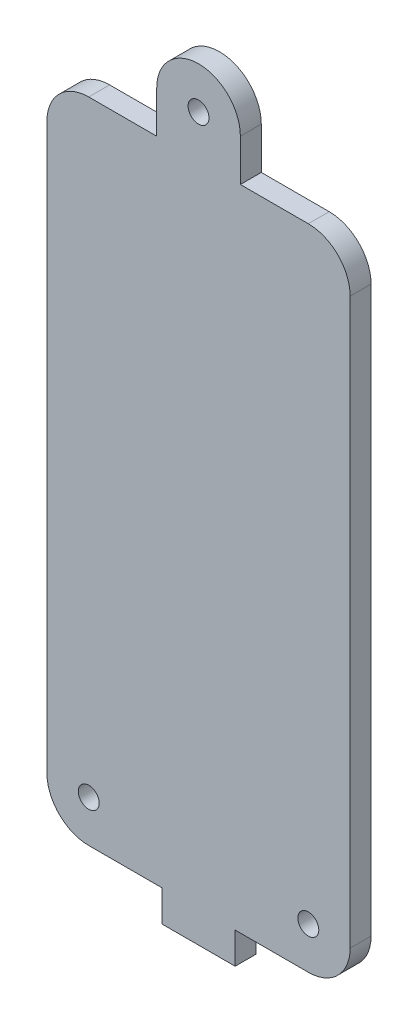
ISO-10303-21;
HEADER;
FILE_DESCRIPTION(('STEP AP214'),'2;1');
FILE_NAME('part.step','',(''),(''),'','','');
FILE_SCHEMA(('AUTOMOTIVE_DESIGN { 1 0 10303 214 1 1 1 1 }'));
ENDSEC;
DATA;
#1=APPLICATION_CONTEXT('core data for automotive mechanical design processes');
#2=APPLICATION_PROTOCOL_DEFINITION('international standard','automotive_design',2000,#1);
#3=PRODUCT_CONTEXT('',#1,'mechanical');
#4=PRODUCT('Part','Part','',(#3));
#5=PRODUCT_RELATED_PRODUCT_CATEGORY('part','',(#4));
#6=PRODUCT_DEFINITION_FORMATION('','',#4);
#7=PRODUCT_DEFINITION_CONTEXT('part definition',#1,'design');
#8=PRODUCT_DEFINITION('design','',#6,#7);
#9=PRODUCT_DEFINITION_SHAPE('','',#8);
#10=(LENGTH_UNIT() NAMED_UNIT(*) SI_UNIT(.MILLI.,.METRE.));
#11=(NAMED_UNIT(*) PLANE_ANGLE_UNIT() SI_UNIT($,.RADIAN.));
#12=(NAMED_UNIT(*) SI_UNIT($,.STERADIAN.) SOLID_ANGLE_UNIT());
#13=UNCERTAINTY_MEASURE_WITH_UNIT(LENGTH_MEASURE(1.E-05),#10,'distance_accuracy_value','');
#14=(GEOMETRIC_REPRESENTATION_CONTEXT(3) GLOBAL_UNCERTAINTY_ASSIGNED_CONTEXT((#13)) GLOBAL_UNIT_ASSIGNED_CONTEXT((#10,
#11,#12)) REPRESENTATION_CONTEXT('',''));
#15=CARTESIAN_POINT('',(0.,0.,0.));
#16=DIRECTION('',(0.,0.,1.));
#17=DIRECTION('',(1.,0.,0.));
#18=AXIS2_PLACEMENT_3D('',#15,#16,#17);
#19=CARTESIAN_POINT('',(-3.5,0.,2.));
#20=DIRECTION('',(1.,0.,0.));
#21=DIRECTION('',(0.,0.,-1.));
#22=AXIS2_PLACEMENT_3D('',#19,#20,#21);
#23=PLANE('',#22);
#24=DIRECTION('',(0.,-1.,0.));
#25=VECTOR('',#24,1.);
#26=CARTESIAN_POINT('',(-3.5,0.,0.));
#27=LINE('',#26,#25);
#28=CARTESIAN_POINT('',(-3.5,3.,0.));
#29=VERTEX_POINT('',#28);
#30=CARTESIAN_POINT('',(-3.5,0.,0.));
#31=VERTEX_POINT('',#30);
#32=EDGE_CURVE('E180',#29,#31,#27,.T.);
#33=ORIENTED_EDGE('',*,*,#32,.T.);
#34=DIRECTION('',(0.,0.,-1.));
#35=VECTOR('',#34,1.);
#36=CARTESIAN_POINT('',(-3.5,0.,2.));
#37=LINE('',#36,#35);
#38=CARTESIAN_POINT('',(-3.5,0.,2.));
#39=VERTEX_POINT('',#38);
#40=EDGE_CURVE('E11',#39,#31,#37,.T.);
#41=ORIENTED_EDGE('',*,*,#40,.F.);
#42=DIRECTION('',(0.,-1.,0.));
#43=VECTOR('',#42,1.);
#44=CARTESIAN_POINT('',(-3.5,0.,2.));
#45=LINE('',#44,#43);
#46=CARTESIAN_POINT('',(-3.5,3.,2.));
#47=VERTEX_POINT('',#46);
#48=EDGE_CURVE('E211',#47,#39,#45,.T.);
#49=ORIENTED_EDGE('',*,*,#48,.F.);
#50=DIRECTION('',(0.,0.,-1.));
#51=VECTOR('',#50,1.);
#52=CARTESIAN_POINT('',(-3.5,3.,2.));
#53=LINE('',#52,#51);
#54=EDGE_CURVE('E176',#47,#29,#53,.T.);
#55=ORIENTED_EDGE('',*,*,#54,.T.);
#56=EDGE_LOOP('',(#33,#41,#49,#55));
#57=FACE_BOUND('',#56,.T.);
#58=ADVANCED_FACE('F36',(#57),#23,.F.);
#59=CARTESIAN_POINT('',(3.5,0.,2.));
#60=DIRECTION('',(0.,1.,0.));
#61=DIRECTION('',(0.,0.,1.));
#62=AXIS2_PLACEMENT_3D('',#59,#60,#61);
#63=PLANE('',#62);
#64=DIRECTION('',(1.,0.,0.));
#65=VECTOR('',#64,1.);
#66=CARTESIAN_POINT('',(3.5,0.,0.));
#67=LINE('',#66,#65);
#68=CARTESIAN_POINT('',(3.5,0.,0.));
#69=VERTEX_POINT('',#68);
#70=EDGE_CURVE('E183',#31,#69,#67,.T.);
#71=ORIENTED_EDGE('',*,*,#70,.T.);
#72=DIRECTION('',(0.,0.,-1.));
#73=VECTOR('',#72,1.);
#74=CARTESIAN_POINT('',(3.5,0.,2.));
#75=LINE('',#74,#73);
#76=CARTESIAN_POINT('',(3.5,0.,2.));
#77=VERTEX_POINT('',#76);
#78=EDGE_CURVE('E44',#77,#69,#75,.T.);
#79=ORIENTED_EDGE('',*,*,#78,.F.);
#80=DIRECTION('',(1.,0.,0.));
#81=VECTOR('',#80,1.);
#82=CARTESIAN_POINT('',(3.5,0.,2.));
#83=LINE('',#82,#81);
#84=EDGE_CURVE('E119',#39,#77,#83,.T.);
#85=ORIENTED_EDGE('',*,*,#84,.F.);
#86=ORIENTED_EDGE('',*,*,#40,.T.);
#87=EDGE_LOOP('',(#71,#79,#85,#86));
#88=FACE_BOUND('',#87,.T.);
#89=ADVANCED_FACE('F311',(#88),#63,.F.);
#90=CARTESIAN_POINT('',(3.5,0.,2.));
#91=DIRECTION('',(-1.,0.,0.));
#92=DIRECTION('',(0.,0.,1.));
#93=AXIS2_PLACEMENT_3D('',#90,#91,#92);
#94=PLANE('',#93);
#95=DIRECTION('',(0.,1.,0.));
#96=VECTOR('',#95,1.);
#97=CARTESIAN_POINT('',(3.5,0.,0.));
#98=LINE('',#97,#96);
#99=CARTESIAN_POINT('',(3.5,3.,0.));
#100=VERTEX_POINT('',#99);
#101=EDGE_CURVE('E186',#69,#100,#98,.T.);
#102=ORIENTED_EDGE('',*,*,#101,.T.);
#103=DIRECTION('',(0.,0.,-1.));
#104=VECTOR('',#103,1.);
#105=CARTESIAN_POINT('',(3.5,3.,2.));
#106=LINE('',#105,#104);
#107=CARTESIAN_POINT('',(3.5,3.,2.));
#108=VERTEX_POINT('',#107);
#109=EDGE_CURVE('E242',#108,#100,#106,.T.);
#110=ORIENTED_EDGE('',*,*,#109,.F.);
#111=DIRECTION('',(0.,1.,0.));
#112=VECTOR('',#111,1.);
#113=CARTESIAN_POINT('',(3.5,0.,2.));
#114=LINE('',#113,#112);
#115=EDGE_CURVE('E250',#77,#108,#114,.T.);
#116=ORIENTED_EDGE('',*,*,#115,.F.);
#117=ORIENTED_EDGE('',*,*,#78,.T.);
#118=EDGE_LOOP('',(#102,#110,#116,#117));
#119=FACE_BOUND('',#118,.T.);
#120=ADVANCED_FACE('F248',(#119),#94,.F.);
#121=CARTESIAN_POINT('',(3.5,3.,2.));
#122=DIRECTION('',(0.,1.,0.));
#123=DIRECTION('',(-1.,0.,0.));
#124=AXIS2_PLACEMENT_3D('',#121,#122,#123);
#125=PLANE('',#124);
#126=DIRECTION('',(1.,0.,0.));
#127=VECTOR('',#126,1.);
#128=CARTESIAN_POINT('',(3.5,3.,0.));
#129=LINE('',#128,#127);
#130=CARTESIAN_POINT('',(10.5,3.,0.));
#131=VERTEX_POINT('',#130);
#132=EDGE_CURVE('E188',#100,#131,#129,.T.);
#133=ORIENTED_EDGE('',*,*,#132,.T.);
#134=DIRECTION('',(0.,0.,-1.));
#135=VECTOR('',#134,1.);
#136=CARTESIAN_POINT('',(10.5,3.,2.));
#137=LINE('',#136,#135);
#138=CARTESIAN_POINT('',(10.5,3.,2.));
#139=VERTEX_POINT('',#138);
#140=EDGE_CURVE('E239',#139,#131,#137,.T.);
#141=ORIENTED_EDGE('',*,*,#140,.F.);
#142=DIRECTION('',(1.,0.,0.));
#143=VECTOR('',#142,1.);
#144=CARTESIAN_POINT('',(3.5,3.,2.));
#145=LINE('',#144,#143);
#146=EDGE_CURVE('E268',#108,#139,#145,.T.);
#147=ORIENTED_EDGE('',*,*,#146,.F.);
#148=ORIENTED_EDGE('',*,*,#109,.T.);
#149=EDGE_LOOP('',(#133,#141,#147,#148));
#150=FACE_BOUND('',#149,.T.);
#151=ADVANCED_FACE('F259',(#150),#125,.F.);
#152=CARTESIAN_POINT('',(10.5,7.,2.));
#153=DIRECTION('',(0.,0.,-1.));
#154=DIRECTION('',(-1.,0.,0.));
#155=AXIS2_PLACEMENT_3D('',#152,#153,#154);
#156=CYLINDRICAL_SURFACE('',#155,4.);
#157=CARTESIAN_POINT('',(10.5,7.,0.));
#158=DIRECTION('',(0.,0.,1.));
#159=DIRECTION('',(1.,0.,0.));
#160=AXIS2_PLACEMENT_3D('',#157,#158,#159);
#161=CIRCLE('',#160,4.);
#162=CARTESIAN_POINT('',(14.5,7.,0.));
#163=VERTEX_POINT('',#162);
#164=EDGE_CURVE('E190',#131,#163,#161,.T.);
#165=ORIENTED_EDGE('',*,*,#164,.T.);
#166=DIRECTION('',(0.,0.,-1.));
#167=VECTOR('',#166,1.);
#168=CARTESIAN_POINT('',(14.5,7.,2.));
#169=LINE('',#168,#167);
#170=CARTESIAN_POINT('',(14.5,7.,2.));
#171=VERTEX_POINT('',#170);
#172=EDGE_CURVE('E236',#171,#163,#169,.T.);
#173=ORIENTED_EDGE('',*,*,#172,.F.);
#174=CARTESIAN_POINT('',(10.5,7.,2.));
#175=DIRECTION('',(0.,0.,1.));
#176=DIRECTION('',(1.,0.,0.));
#177=AXIS2_PLACEMENT_3D('',#174,#175,#176);
#178=CIRCLE('',#177,4.);
#179=EDGE_CURVE('E265',#139,#171,#178,.T.);
#180=ORIENTED_EDGE('',*,*,#179,.F.);
#181=ORIENTED_EDGE('',*,*,#140,.T.);
#182=EDGE_LOOP('',(#165,#173,#180,#181));
#183=FACE_BOUND('',#182,.T.);
#184=ADVANCED_FACE('F263',(#183),#156,.T.);
#185=CARTESIAN_POINT('',(14.5,7.,2.));
#186=DIRECTION('',(-1.,0.,0.));
#187=DIRECTION('',(0.,-1.,0.));
#188=AXIS2_PLACEMENT_3D('',#185,#186,#187);
#189=PLANE('',#188);
#190=DIRECTION('',(0.,1.,0.));
#191=VECTOR('',#190,1.);
#192=CARTESIAN_POINT('',(14.5,7.,0.));
#193=LINE('',#192,#191);
#194=CARTESIAN_POINT('',(14.5,61.,0.));
#195=VERTEX_POINT('',#194);
#196=EDGE_CURVE('E192',#163,#195,#193,.T.);
#197=ORIENTED_EDGE('',*,*,#196,.T.);
#198=DIRECTION('',(0.,0.,-1.));
#199=VECTOR('',#198,1.);
#200=CARTESIAN_POINT('',(14.5,61.,2.));
#201=LINE('',#200,#199);
#202=CARTESIAN_POINT('',(14.5,61.,2.));
#203=VERTEX_POINT('',#202);
#204=EDGE_CURVE('E233',#203,#195,#201,.T.);
#205=ORIENTED_EDGE('',*,*,#204,.F.);
#206=DIRECTION('',(0.,1.,0.));
#207=VECTOR('',#206,1.);
#208=CARTESIAN_POINT('',(14.5,7.,2.));
#209=LINE('',#208,#207);
#210=EDGE_CURVE('E267',#171,#203,#209,.T.);
#211=ORIENTED_EDGE('',*,*,#210,.F.);
#212=ORIENTED_EDGE('',*,*,#172,.T.);
#213=EDGE_LOOP('',(#197,#205,#211,#212));
#214=FACE_BOUND('',#213,.T.);
#215=ADVANCED_FACE('F324',(#214),#189,.F.);
#216=CARTESIAN_POINT('',(10.5,61.,2.));
#217=DIRECTION('',(0.,0.,-1.));
#218=DIRECTION('',(-1.,0.,0.));
#219=AXIS2_PLACEMENT_3D('',#216,#217,#218);
#220=CYLINDRICAL_SURFACE('',#219,4.00000000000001);
#221=CARTESIAN_POINT('',(10.5,61.,0.));
#222=DIRECTION('',(0.,0.,1.));
#223=DIRECTION('',(1.,0.,0.));
#224=AXIS2_PLACEMENT_3D('',#221,#222,#223);
#225=CIRCLE('',#224,4.00000000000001);
#226=CARTESIAN_POINT('',(10.5,65.,0.));
#227=VERTEX_POINT('',#226);
#228=EDGE_CURVE('E194',#195,#227,#225,.T.);
#229=ORIENTED_EDGE('',*,*,#228,.T.);
#230=DIRECTION('',(0.,0.,-1.));
#231=VECTOR('',#230,1.);
#232=CARTESIAN_POINT('',(10.5,65.,2.));
#233=LINE('',#232,#231);
#234=CARTESIAN_POINT('',(10.5,65.,2.));
#235=VERTEX_POINT('',#234);
#236=EDGE_CURVE('E230',#235,#227,#233,.T.);
#237=ORIENTED_EDGE('',*,*,#236,.F.);
#238=CARTESIAN_POINT('',(10.5,61.,2.));
#239=DIRECTION('',(0.,0.,1.));
#240=DIRECTION('',(1.,0.,0.));
#241=AXIS2_PLACEMENT_3D('',#238,#239,#240);
#242=CIRCLE('',#241,4.00000000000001);
#243=EDGE_CURVE('E270',#203,#235,#242,.T.);
#244=ORIENTED_EDGE('',*,*,#243,.F.);
#245=ORIENTED_EDGE('',*,*,#204,.T.);
#246=EDGE_LOOP('',(#229,#237,#244,#245));
#247=FACE_BOUND('',#246,.T.);
#248=ADVANCED_FACE('F327',(#247),#220,.T.);
#249=CARTESIAN_POINT('',(10.5,65.,2.));
#250=DIRECTION('',(0.,-1.,0.));
#251=DIRECTION('',(1.,0.,0.));
#252=AXIS2_PLACEMENT_3D('',#249,#250,#251);
#253=PLANE('',#252);
#254=DIRECTION('',(-1.,0.,0.));
#255=VECTOR('',#254,1.);
#256=CARTESIAN_POINT('',(10.5,65.,0.));
#257=LINE('',#256,#255);
#258=CARTESIAN_POINT('',(4.,65.,0.));
#259=VERTEX_POINT('',#258);
#260=EDGE_CURVE('E196',#227,#259,#257,.T.);
#261=ORIENTED_EDGE('',*,*,#260,.T.);
#262=DIRECTION('',(0.,0.,-1.));
#263=VECTOR('',#262,1.);
#264=CARTESIAN_POINT('',(4.,65.,2.));
#265=LINE('',#264,#263);
#266=CARTESIAN_POINT('',(4.,65.,2.));
#267=VERTEX_POINT('',#266);
#268=EDGE_CURVE('E227',#267,#259,#265,.T.);
#269=ORIENTED_EDGE('',*,*,#268,.F.);
#270=DIRECTION('',(-1.,0.,0.));
#271=VECTOR('',#270,1.);
#272=CARTESIAN_POINT('',(10.5,65.,2.));
#273=LINE('',#272,#271);
#274=EDGE_CURVE('E276',#235,#267,#273,.T.);
#275=ORIENTED_EDGE('',*,*,#274,.F.);
#276=ORIENTED_EDGE('',*,*,#236,.T.);
#277=EDGE_LOOP('',(#261,#269,#275,#276));
#278=FACE_BOUND('',#277,.T.);
#279=ADVANCED_FACE('F331',(#278),#253,.F.);
#280=CARTESIAN_POINT('',(4.,65.,2.));
#281=DIRECTION('',(-1.,0.,0.));
#282=DIRECTION('',(0.,0.,1.));
#283=AXIS2_PLACEMENT_3D('',#280,#281,#282);
#284=PLANE('',#283);
#285=DIRECTION('',(0.,1.,0.));
#286=VECTOR('',#285,1.);
#287=CARTESIAN_POINT('',(4.,65.,0.));
#288=LINE('',#287,#286);
#289=CARTESIAN_POINT('',(4.,69.,0.));
#290=VERTEX_POINT('',#289);
#291=EDGE_CURVE('E198',#259,#290,#288,.T.);
#292=ORIENTED_EDGE('',*,*,#291,.T.);
#293=DIRECTION('',(0.,0.,-1.));
#294=VECTOR('',#293,1.);
#295=CARTESIAN_POINT('',(4.,69.,2.));
#296=LINE('',#295,#294);
#297=CARTESIAN_POINT('',(4.,69.,2.));
#298=VERTEX_POINT('',#297);
#299=EDGE_CURVE('E224',#298,#290,#296,.T.);
#300=ORIENTED_EDGE('',*,*,#299,.F.);
#301=DIRECTION('',(0.,1.,0.));
#302=VECTOR('',#301,1.);
#303=CARTESIAN_POINT('',(4.,65.,2.));
#304=LINE('',#303,#302);
#305=EDGE_CURVE('E278',#267,#298,#304,.T.);
#306=ORIENTED_EDGE('',*,*,#305,.F.);
#307=ORIENTED_EDGE('',*,*,#268,.T.);
#308=EDGE_LOOP('',(#292,#300,#306,#307));
#309=FACE_BOUND('',#308,.T.);
#310=ADVANCED_FACE('F335',(#309),#284,.F.);
#311=CARTESIAN_POINT('',(0.,69.,2.));
#312=DIRECTION('',(0.,0.,-1.));
#313=DIRECTION('',(-1.,0.,0.));
#314=AXIS2_PLACEMENT_3D('',#311,#312,#313);
#315=CYLINDRICAL_SURFACE('',#314,4.);
#316=CARTESIAN_POINT('',(0.,69.,0.));
#317=DIRECTION('',(0.,0.,1.));
#318=DIRECTION('',(-1.,0.,0.));
#319=AXIS2_PLACEMENT_3D('',#316,#317,#318);
#320=CIRCLE('',#319,4.);
#321=CARTESIAN_POINT('',(-4.,69.,0.));
#322=VERTEX_POINT('',#321);
#323=EDGE_CURVE('E200',#290,#322,#320,.T.);
#324=ORIENTED_EDGE('',*,*,#323,.T.);
#325=DIRECTION('',(0.,0.,-1.));
#326=VECTOR('',#325,1.);
#327=CARTESIAN_POINT('',(-4.,69.,2.));
#328=LINE('',#327,#326);
#329=CARTESIAN_POINT('',(-4.,69.,2.));
#330=VERTEX_POINT('',#329);
#331=EDGE_CURVE('E221',#330,#322,#328,.T.);
#332=ORIENTED_EDGE('',*,*,#331,.F.);
#333=CARTESIAN_POINT('',(0.,69.,2.));
#334=DIRECTION('',(0.,0.,1.));
#335=DIRECTION('',(-1.,0.,0.));
#336=AXIS2_PLACEMENT_3D('',#333,#334,#335);
#337=CIRCLE('',#336,4.);
#338=EDGE_CURVE('E280',#298,#330,#337,.T.);
#339=ORIENTED_EDGE('',*,*,#338,.F.);
#340=ORIENTED_EDGE('',*,*,#299,.T.);
#341=EDGE_LOOP('',(#324,#332,#339,#340));
#342=FACE_BOUND('',#341,.T.);
#343=ADVANCED_FACE('F339',(#342),#315,.T.);
#344=CARTESIAN_POINT('',(-4.,65.,2.));
#345=DIRECTION('',(1.,0.,0.));
#346=DIRECTION('',(0.,0.,-1.));
#347=AXIS2_PLACEMENT_3D('',#344,#345,#346);
#348=PLANE('',#347);
#349=DIRECTION('',(0.,-1.,0.));
#350=VECTOR('',#349,1.);
#351=CARTESIAN_POINT('',(-4.,65.,0.));
#352=LINE('',#351,#350);
#353=CARTESIAN_POINT('',(-4.,65.,0.));
#354=VERTEX_POINT('',#353);
#355=EDGE_CURVE('E202',#322,#354,#352,.T.);
#356=ORIENTED_EDGE('',*,*,#355,.T.);
#357=DIRECTION('',(0.,0.,-1.));
#358=VECTOR('',#357,1.);
#359=CARTESIAN_POINT('',(-4.,65.,2.));
#360=LINE('',#359,#358);
#361=CARTESIAN_POINT('',(-4.,65.,2.));
#362=VERTEX_POINT('',#361);
#363=EDGE_CURVE('E218',#362,#354,#360,.T.);
#364=ORIENTED_EDGE('',*,*,#363,.F.);
#365=DIRECTION('',(0.,-1.,0.));
#366=VECTOR('',#365,1.);
#367=CARTESIAN_POINT('',(-4.,65.,2.));
#368=LINE('',#367,#366);
#369=EDGE_CURVE('E282',#330,#362,#368,.T.);
#370=ORIENTED_EDGE('',*,*,#369,.F.);
#371=ORIENTED_EDGE('',*,*,#331,.T.);
#372=EDGE_LOOP('',(#356,#364,#370,#371));
#373=FACE_BOUND('',#372,.T.);
#374=ADVANCED_FACE('F343',(#373),#348,.F.);
#375=CARTESIAN_POINT('',(-10.5,65.,2.));
#376=DIRECTION('',(0.,-1.,0.));
#377=DIRECTION('',(1.,0.,0.));
#378=AXIS2_PLACEMENT_3D('',#375,#376,#377);
#379=PLANE('',#378);
#380=DIRECTION('',(-1.,0.,0.));
#381=VECTOR('',#380,1.);
#382=CARTESIAN_POINT('',(-10.5,65.,0.));
#383=LINE('',#382,#381);
#384=CARTESIAN_POINT('',(-10.5,65.,0.));
#385=VERTEX_POINT('',#384);
#386=EDGE_CURVE('E204',#354,#385,#383,.T.);
#387=ORIENTED_EDGE('',*,*,#386,.T.);
#388=DIRECTION('',(0.,0.,-1.));
#389=VECTOR('',#388,1.);
#390=CARTESIAN_POINT('',(-10.5,65.,2.));
#391=LINE('',#390,#389);
#392=CARTESIAN_POINT('',(-10.5,65.,2.));
#393=VERTEX_POINT('',#392);
#394=EDGE_CURVE('E215',#393,#385,#391,.T.);
#395=ORIENTED_EDGE('',*,*,#394,.F.);
#396=DIRECTION('',(-1.,0.,0.));
#397=VECTOR('',#396,1.);
#398=CARTESIAN_POINT('',(-10.5,65.,2.));
#399=LINE('',#398,#397);
#400=EDGE_CURVE('E284',#362,#393,#399,.T.);
#401=ORIENTED_EDGE('',*,*,#400,.F.);
#402=ORIENTED_EDGE('',*,*,#363,.T.);
#403=EDGE_LOOP('',(#387,#395,#401,#402));
#404=FACE_BOUND('',#403,.T.);
#405=ADVANCED_FACE('F290',(#404),#379,.F.);
#406=CARTESIAN_POINT('',(-10.5,61.,2.));
#407=DIRECTION('',(0.,0.,-1.));
#408=DIRECTION('',(-1.,0.,0.));
#409=AXIS2_PLACEMENT_3D('',#406,#407,#408);
#410=CYLINDRICAL_SURFACE('',#409,4.00000000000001);
#411=CARTESIAN_POINT('',(-10.5,61.,0.));
#412=DIRECTION('',(0.,0.,1.));
#413=DIRECTION('',(-1.,0.,0.));
#414=AXIS2_PLACEMENT_3D('',#411,#412,#413);
#415=CIRCLE('',#414,4.00000000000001);
#416=CARTESIAN_POINT('',(-14.5,61.,0.));
#417=VERTEX_POINT('',#416);
#418=EDGE_CURVE('E206',#385,#417,#415,.T.);
#419=ORIENTED_EDGE('',*,*,#418,.T.);
#420=DIRECTION('',(0.,0.,-1.));
#421=VECTOR('',#420,1.);
#422=CARTESIAN_POINT('',(-14.5,61.,2.));
#423=LINE('',#422,#421);
#424=CARTESIAN_POINT('',(-14.5,61.,2.));
#425=VERTEX_POINT('',#424);
#426=EDGE_CURVE('E171',#425,#417,#423,.T.);
#427=ORIENTED_EDGE('',*,*,#426,.F.);
#428=CARTESIAN_POINT('',(-10.5,61.,2.));
#429=DIRECTION('',(0.,0.,1.));
#430=DIRECTION('',(-1.,0.,0.));
#431=AXIS2_PLACEMENT_3D('',#428,#429,#430);
#432=CIRCLE('',#431,4.00000000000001);
#433=EDGE_CURVE('E162',#393,#425,#432,.T.);
#434=ORIENTED_EDGE('',*,*,#433,.F.);
#435=ORIENTED_EDGE('',*,*,#394,.T.);
#436=EDGE_LOOP('',(#419,#427,#434,#435));
#437=FACE_BOUND('',#436,.T.);
#438=ADVANCED_FACE('F294',(#437),#410,.T.);
#439=CARTESIAN_POINT('',(-14.5,7.,2.));
#440=DIRECTION('',(1.,0.,0.));
#441=DIRECTION('',(0.,1.,0.));
#442=AXIS2_PLACEMENT_3D('',#439,#440,#441);
#443=PLANE('',#442);
#444=DIRECTION('',(0.,-1.,0.));
#445=VECTOR('',#444,1.);
#446=CARTESIAN_POINT('',(-14.5,7.,0.));
#447=LINE('',#446,#445);
#448=CARTESIAN_POINT('',(-14.5,7.,0.));
#449=VERTEX_POINT('',#448);
#450=EDGE_CURVE('E170',#417,#449,#447,.T.);
#451=ORIENTED_EDGE('',*,*,#450,.T.);
#452=DIRECTION('',(0.,0.,-1.));
#453=VECTOR('',#452,1.);
#454=CARTESIAN_POINT('',(-14.5,7.,2.));
#455=LINE('',#454,#453);
#456=CARTESIAN_POINT('',(-14.5,7.,2.));
#457=VERTEX_POINT('',#456);
#458=EDGE_CURVE('E167',#457,#449,#455,.T.);
#459=ORIENTED_EDGE('',*,*,#458,.F.);
#460=DIRECTION('',(0.,-1.,0.));
#461=VECTOR('',#460,1.);
#462=CARTESIAN_POINT('',(-14.5,7.,2.));
#463=LINE('',#462,#461);
#464=EDGE_CURVE('E156',#425,#457,#463,.T.);
#465=ORIENTED_EDGE('',*,*,#464,.F.);
#466=ORIENTED_EDGE('',*,*,#426,.T.);
#467=EDGE_LOOP('',(#451,#459,#465,#466));
#468=FACE_BOUND('',#467,.T.);
#469=ADVANCED_FACE('F168',(#468),#443,.F.);
#470=CARTESIAN_POINT('',(-10.5,7.,2.));
#471=DIRECTION('',(0.,0.,-1.));
#472=DIRECTION('',(-1.,0.,0.));
#473=AXIS2_PLACEMENT_3D('',#470,#471,#472);
#474=CYLINDRICAL_SURFACE('',#473,4.);
#475=CARTESIAN_POINT('',(-10.5,7.,0.));
#476=DIRECTION('',(0.,0.,1.));
#477=DIRECTION('',(-1.,0.,0.));
#478=AXIS2_PLACEMENT_3D('',#475,#476,#477);
#479=CIRCLE('',#478,4.);
#480=CARTESIAN_POINT('',(-10.5,3.,0.));
#481=VERTEX_POINT('',#480);
#482=EDGE_CURVE('E105',#449,#481,#479,.T.);
#483=ORIENTED_EDGE('',*,*,#482,.T.);
#484=DIRECTION('',(0.,0.,-1.));
#485=VECTOR('',#484,1.);
#486=CARTESIAN_POINT('',(-10.5,3.,2.));
#487=LINE('',#486,#485);
#488=CARTESIAN_POINT('',(-10.5,3.,2.));
#489=VERTEX_POINT('',#488);
#490=EDGE_CURVE('E172',#489,#481,#487,.T.);
#491=ORIENTED_EDGE('',*,*,#490,.F.);
#492=CARTESIAN_POINT('',(-10.5,7.,2.));
#493=DIRECTION('',(0.,0.,1.));
#494=DIRECTION('',(-1.,0.,0.));
#495=AXIS2_PLACEMENT_3D('',#492,#493,#494);
#496=CIRCLE('',#495,4.);
#497=EDGE_CURVE('E160',#457,#489,#496,.T.);
#498=ORIENTED_EDGE('',*,*,#497,.F.);
#499=ORIENTED_EDGE('',*,*,#458,.T.);
#500=EDGE_LOOP('',(#483,#491,#498,#499));
#501=FACE_BOUND('',#500,.T.);
#502=ADVANCED_FACE('F174',(#501),#474,.T.);
#503=CARTESIAN_POINT('',(-3.5,3.,2.));
#504=DIRECTION('',(0.,1.,0.));
#505=DIRECTION('',(-1.,0.,0.));
#506=AXIS2_PLACEMENT_3D('',#503,#504,#505);
#507=PLANE('',#506);
#508=DIRECTION('',(1.,0.,0.));
#509=VECTOR('',#508,1.);
#510=CARTESIAN_POINT('',(-3.5,3.,0.));
#511=LINE('',#510,#509);
#512=EDGE_CURVE('E111',#481,#29,#511,.T.);
#513=ORIENTED_EDGE('',*,*,#512,.T.);
#514=ORIENTED_EDGE('',*,*,#54,.F.);
#515=DIRECTION('',(1.,0.,0.));
#516=VECTOR('',#515,1.);
#517=CARTESIAN_POINT('',(-3.5,3.,2.));
#518=LINE('',#517,#516);
#519=EDGE_CURVE('E52',#489,#47,#518,.T.);
#520=ORIENTED_EDGE('',*,*,#519,.F.);
#521=ORIENTED_EDGE('',*,*,#490,.T.);
#522=EDGE_LOOP('',(#513,#514,#520,#521));
#523=FACE_BOUND('',#522,.T.);
#524=ADVANCED_FACE('F298',(#523),#507,.F.);
#525=CARTESIAN_POINT('',(-10.5,7.,2.));
#526=DIRECTION('',(0.,0.,-1.));
#527=DIRECTION('',(-1.,0.,0.));
#528=AXIS2_PLACEMENT_3D('',#525,#526,#527);
#529=PLANE('',#528);
#530=CARTESIAN_POINT('',(0.,69.,2.));
#531=DIRECTION('',(0.,0.,1.));
#532=DIRECTION('',(1.,0.,0.));
#533=AXIS2_PLACEMENT_3D('',#530,#531,#532);
#534=CIRCLE('',#533,1.);
#535=CARTESIAN_POINT('',(1.,69.,2.));
#536=VERTEX_POINT('',#535);
#537=EDGE_CURVE('E413',#536,#536,#534,.T.);
#538=ORIENTED_EDGE('',*,*,#537,.F.);
#539=EDGE_LOOP('',(#538));
#540=FACE_BOUND('',#539,.T.);
#541=CARTESIAN_POINT('',(10.5,7.,2.));
#542=DIRECTION('',(0.,0.,1.));
#543=DIRECTION('',(1.,0.,0.));
#544=AXIS2_PLACEMENT_3D('',#541,#542,#543);
#545=CIRCLE('',#544,1.);
#546=CARTESIAN_POINT('',(11.5,7.,2.));
#547=VERTEX_POINT('',#546);
#548=EDGE_CURVE('E418',#547,#547,#545,.T.);
#549=ORIENTED_EDGE('',*,*,#548,.F.);
#550=EDGE_LOOP('',(#549));
#551=FACE_BOUND('',#550,.T.);
#552=CARTESIAN_POINT('',(-10.5,7.,2.));
#553=DIRECTION('',(0.,0.,1.));
#554=DIRECTION('',(1.,0.,0.));
#555=AXIS2_PLACEMENT_3D('',#552,#553,#554);
#556=CIRCLE('',#555,1.);
#557=CARTESIAN_POINT('',(-9.5,7.,2.));
#558=VERTEX_POINT('',#557);
#559=EDGE_CURVE('E426',#558,#558,#556,.T.);
#560=ORIENTED_EDGE('',*,*,#559,.F.);
#561=EDGE_LOOP('',(#560));
#562=FACE_BOUND('',#561,.T.);
#563=ORIENTED_EDGE('',*,*,#48,.T.);
#564=ORIENTED_EDGE('',*,*,#84,.T.);
#565=ORIENTED_EDGE('',*,*,#115,.T.);
#566=ORIENTED_EDGE('',*,*,#146,.T.);
#567=ORIENTED_EDGE('',*,*,#179,.T.);
#568=ORIENTED_EDGE('',*,*,#210,.T.);
#569=ORIENTED_EDGE('',*,*,#243,.T.);
#570=ORIENTED_EDGE('',*,*,#274,.T.);
#571=ORIENTED_EDGE('',*,*,#305,.T.);
#572=ORIENTED_EDGE('',*,*,#338,.T.);
#573=ORIENTED_EDGE('',*,*,#369,.T.);
#574=ORIENTED_EDGE('',*,*,#400,.T.);
#575=ORIENTED_EDGE('',*,*,#433,.T.);
#576=ORIENTED_EDGE('',*,*,#464,.T.);
#577=ORIENTED_EDGE('',*,*,#497,.T.);
#578=ORIENTED_EDGE('',*,*,#519,.T.);
#579=EDGE_LOOP('',(#563,#564,#565,#566,#567,#568,#569,#570,#571,#572,#573,#574,#575,#576,#577,#578));
#580=FACE_BOUND('',#579,.T.);
#581=ADVANCED_FACE('F158',(#540,#551,#562,#580),#529,.F.);
#582=CARTESIAN_POINT('',(-10.5,7.,0.));
#583=DIRECTION('',(0.,0.,-1.));
#584=DIRECTION('',(-1.,0.,0.));
#585=AXIS2_PLACEMENT_3D('',#582,#583,#584);
#586=PLANE('',#585);
#587=CARTESIAN_POINT('',(0.,69.,0.));
#588=DIRECTION('',(0.,0.,1.));
#589=DIRECTION('',(1.,0.,0.));
#590=AXIS2_PLACEMENT_3D('',#587,#588,#589);
#591=CIRCLE('',#590,1.);
#592=CARTESIAN_POINT('',(1.,69.,0.));
#593=VERTEX_POINT('',#592);
#594=EDGE_CURVE('E184',#593,#593,#591,.T.);
#595=ORIENTED_EDGE('',*,*,#594,.T.);
#596=EDGE_LOOP('',(#595));
#597=FACE_BOUND('',#596,.T.);
#598=CARTESIAN_POINT('',(10.5,7.,0.));
#599=DIRECTION('',(0.,0.,1.));
#600=DIRECTION('',(1.,0.,0.));
#601=AXIS2_PLACEMENT_3D('',#598,#599,#600);
#602=CIRCLE('',#601,1.);
#603=CARTESIAN_POINT('',(11.5,7.,0.));
#604=VERTEX_POINT('',#603);
#605=EDGE_CURVE('E414',#604,#604,#602,.T.);
#606=ORIENTED_EDGE('',*,*,#605,.T.);
#607=EDGE_LOOP('',(#606));
#608=FACE_BOUND('',#607,.T.);
#609=CARTESIAN_POINT('',(-10.5,7.,0.));
#610=DIRECTION('',(0.,0.,1.));
#611=DIRECTION('',(1.,0.,0.));
#612=AXIS2_PLACEMENT_3D('',#609,#610,#611);
#613=CIRCLE('',#612,1.);
#614=CARTESIAN_POINT('',(-9.5,7.,0.));
#615=VERTEX_POINT('',#614);
#616=EDGE_CURVE('E423',#615,#615,#613,.T.);
#617=ORIENTED_EDGE('',*,*,#616,.T.);
#618=EDGE_LOOP('',(#617));
#619=FACE_BOUND('',#618,.T.);
#620=ORIENTED_EDGE('',*,*,#32,.F.);
#621=ORIENTED_EDGE('',*,*,#512,.F.);
#622=ORIENTED_EDGE('',*,*,#482,.F.);
#623=ORIENTED_EDGE('',*,*,#450,.F.);
#624=ORIENTED_EDGE('',*,*,#418,.F.);
#625=ORIENTED_EDGE('',*,*,#386,.F.);
#626=ORIENTED_EDGE('',*,*,#355,.F.);
#627=ORIENTED_EDGE('',*,*,#323,.F.);
#628=ORIENTED_EDGE('',*,*,#291,.F.);
#629=ORIENTED_EDGE('',*,*,#260,.F.);
#630=ORIENTED_EDGE('',*,*,#228,.F.);
#631=ORIENTED_EDGE('',*,*,#196,.F.);
#632=ORIENTED_EDGE('',*,*,#164,.F.);
#633=ORIENTED_EDGE('',*,*,#132,.F.);
#634=ORIENTED_EDGE('',*,*,#101,.F.);
#635=ORIENTED_EDGE('',*,*,#70,.F.);
#636=EDGE_LOOP('',(#620,#621,#622,#623,#624,#625,#626,#627,#628,#629,#630,#631,#632,#633,#634,#635));
#637=FACE_BOUND('',#636,.T.);
#638=ADVANCED_FACE('F254',(#597,#608,#619,#637),#586,.T.);
#639=CARTESIAN_POINT('',(-10.5,7.,0.));
#640=DIRECTION('',(0.,0.,1.));
#641=DIRECTION('',(1.,0.,0.));
#642=AXIS2_PLACEMENT_3D('',#639,#640,#641);
#643=CYLINDRICAL_SURFACE('',#642,1.);
#644=ORIENTED_EDGE('',*,*,#616,.F.);
#645=EDGE_LOOP('',(#644));
#646=FACE_BOUND('',#645,.T.);
#647=ORIENTED_EDGE('',*,*,#559,.T.);
#648=EDGE_LOOP('',(#647));
#649=FACE_BOUND('',#648,.T.);
#650=ADVANCED_FACE('F376',(#646,#649),#643,.F.);
#651=CARTESIAN_POINT('',(10.5,7.,0.));
#652=DIRECTION('',(0.,0.,1.));
#653=DIRECTION('',(1.,0.,0.));
#654=AXIS2_PLACEMENT_3D('',#651,#652,#653);
#655=CYLINDRICAL_SURFACE('',#654,1.);
#656=ORIENTED_EDGE('',*,*,#605,.F.);
#657=EDGE_LOOP('',(#656));
#658=FACE_BOUND('',#657,.T.);
#659=ORIENTED_EDGE('',*,*,#548,.T.);
#660=EDGE_LOOP('',(#659));
#661=FACE_BOUND('',#660,.T.);
#662=ADVANCED_FACE('F384',(#658,#661),#655,.F.);
#663=CARTESIAN_POINT('',(0.,69.,0.));
#664=DIRECTION('',(0.,0.,1.));
#665=DIRECTION('',(1.,0.,0.));
#666=AXIS2_PLACEMENT_3D('',#663,#664,#665);
#667=CYLINDRICAL_SURFACE('',#666,1.);
#668=ORIENTED_EDGE('',*,*,#594,.F.);
#669=EDGE_LOOP('',(#668));
#670=FACE_BOUND('',#669,.T.);
#671=ORIENTED_EDGE('',*,*,#537,.T.);
#672=EDGE_LOOP('',(#671));
#673=FACE_BOUND('',#672,.T.);
#674=ADVANCED_FACE('F394',(#670,#673),#667,.F.);
#675=CLOSED_SHELL('',(#58,#89,#120,#151,#184,#215,#248,#279,#310,#343,#374,#405,#438,#469,#502,
#524,#581,#638,#650,#662,#674));
#676=MANIFOLD_SOLID_BREP('B2',#675);
#677=ADVANCED_BREP_SHAPE_REPRESENTATION('',(#18,#676),#14);
#678=SHAPE_DEFINITION_REPRESENTATION(#9,#677);
ENDSEC;
END-ISO-10303-21;
